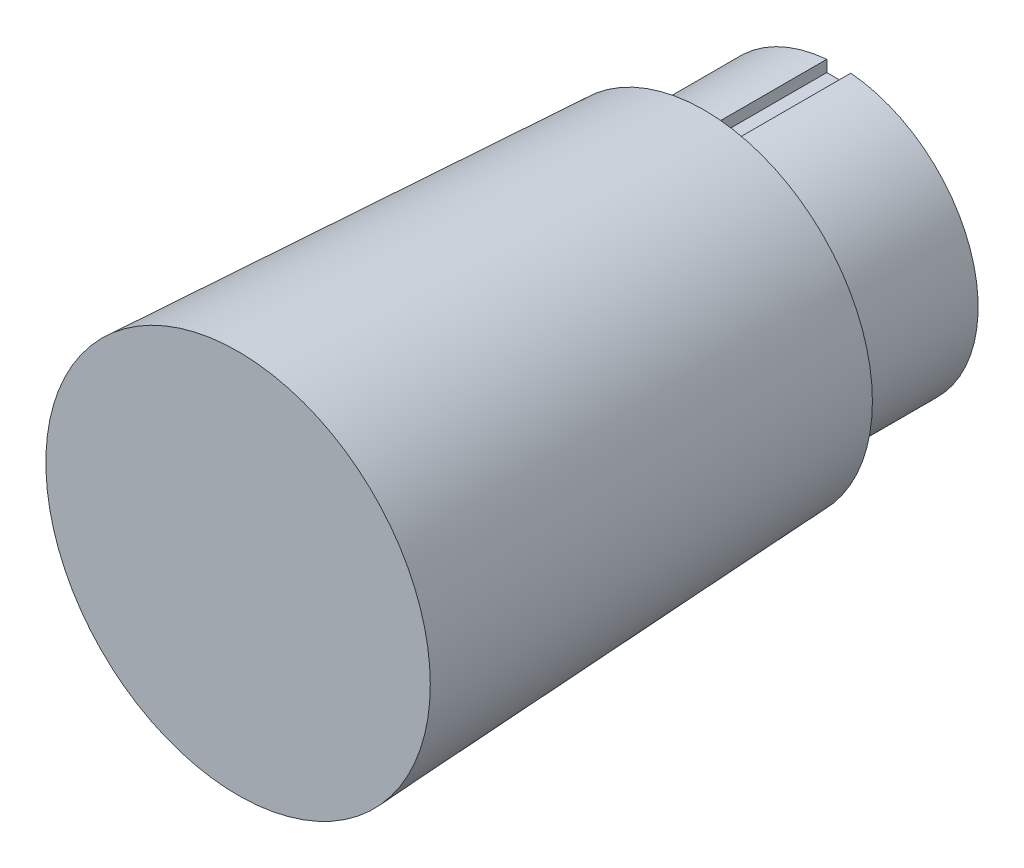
ISO-10303-21;
HEADER;
FILE_DESCRIPTION(('STEP AP214'),'2;1');
FILE_NAME('part.step','',(''),(''),'','','');
FILE_SCHEMA(('AUTOMOTIVE_DESIGN { 1 0 10303 214 1 1 1 1 }'));
ENDSEC;
DATA;
#1=APPLICATION_CONTEXT('core data for automotive mechanical design processes');
#2=APPLICATION_PROTOCOL_DEFINITION('international standard','automotive_design',2000,#1);
#3=PRODUCT_CONTEXT('',#1,'mechanical');
#4=PRODUCT('Part','Part','',(#3));
#5=PRODUCT_RELATED_PRODUCT_CATEGORY('part','',(#4));
#6=PRODUCT_DEFINITION_FORMATION('','',#4);
#7=PRODUCT_DEFINITION_CONTEXT('part definition',#1,'design');
#8=PRODUCT_DEFINITION('design','',#6,#7);
#9=PRODUCT_DEFINITION_SHAPE('','',#8);
#10=(LENGTH_UNIT() NAMED_UNIT(*) SI_UNIT(.MILLI.,.METRE.));
#11=(NAMED_UNIT(*) PLANE_ANGLE_UNIT() SI_UNIT($,.RADIAN.));
#12=(NAMED_UNIT(*) SI_UNIT($,.STERADIAN.) SOLID_ANGLE_UNIT());
#13=UNCERTAINTY_MEASURE_WITH_UNIT(LENGTH_MEASURE(1.E-05),#10,'distance_accuracy_value','');
#14=(GEOMETRIC_REPRESENTATION_CONTEXT(3) GLOBAL_UNCERTAINTY_ASSIGNED_CONTEXT((#13)) GLOBAL_UNIT_ASSIGNED_CONTEXT((#10,
#11,#12)) REPRESENTATION_CONTEXT('',''));
#15=CARTESIAN_POINT('',(0.,0.,0.));
#16=DIRECTION('',(0.,0.,1.));
#17=DIRECTION('',(1.,0.,0.));
#18=AXIS2_PLACEMENT_3D('',#15,#16,#17);
#19=CARTESIAN_POINT('',(0.,0.,0.));
#20=DIRECTION('',(0.,0.,-1.));
#21=DIRECTION('',(-1.,0.,0.));
#22=AXIS2_PLACEMENT_3D('',#19,#20,#21);
#23=PLANE('',#22);
#24=CARTESIAN_POINT('',(0.,0.,0.));
#25=DIRECTION('',(0.,0.,1.));
#26=DIRECTION('',(1.,0.,0.));
#27=AXIS2_PLACEMENT_3D('',#24,#25,#26);
#28=CIRCLE('',#27,40.);
#29=CARTESIAN_POINT('',(40.,0.,0.));
#30=VERTEX_POINT('',#29);
#31=EDGE_CURVE('E40',#30,#30,#28,.T.);
#32=ORIENTED_EDGE('',*,*,#31,.T.);
#33=EDGE_LOOP('',(#32));
#34=FACE_BOUND('',#33,.T.);
#35=ADVANCED_FACE('F33',(#34),#23,.F.);
#36=CARTESIAN_POINT('',(0.,0.,-97.));
#37=DIRECTION('',(0.,0.,1.));
#38=DIRECTION('',(1.,0.,0.));
#39=AXIS2_PLACEMENT_3D('',#36,#37,#38);
#40=CONICAL_SURFACE('',#39,35.,0.0515008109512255);
#41=ORIENTED_EDGE('',*,*,#31,.F.);
#42=EDGE_LOOP('',(#41));
#43=FACE_BOUND('',#42,.T.);
#44=CARTESIAN_POINT('',(0.,0.,-97.));
#45=DIRECTION('',(0.,0.,1.));
#46=DIRECTION('',(1.,0.,0.));
#47=AXIS2_PLACEMENT_3D('',#44,#45,#46);
#48=CIRCLE('',#47,35.);
#49=CARTESIAN_POINT('',(35.,0.,-97.));
#50=VERTEX_POINT('',#49);
#51=EDGE_CURVE('E107',#50,#50,#48,.T.);
#52=ORIENTED_EDGE('',*,*,#51,.T.);
#53=EDGE_LOOP('',(#52));
#54=FACE_BOUND('',#53,.T.);
#55=ADVANCED_FACE('F113',(#43,#54),#40,.T.);
#56=CARTESIAN_POINT('',(0.,29.,-97.));
#57=DIRECTION('',(0.,0.,1.));
#58=DIRECTION('',(1.,0.,0.));
#59=AXIS2_PLACEMENT_3D('',#56,#57,#58);
#60=PLANE('',#59);
#61=DIRECTION('',(0.,1.,0.));
#62=VECTOR('',#61,1.);
#63=CARTESIAN_POINT('',(-2.5,31.5,-97.));
#64=LINE('',#63,#62);
#65=CARTESIAN_POINT('',(-2.5,26.5,-97.));
#66=VERTEX_POINT('',#65);
#67=CARTESIAN_POINT('',(-2.5,28.8920404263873,-97.));
#68=VERTEX_POINT('',#67);
#69=EDGE_CURVE('E70',#66,#68,#64,.T.);
#70=ORIENTED_EDGE('',*,*,#69,.T.);
#71=CARTESIAN_POINT('',(0.,0.,-97.));
#72=DIRECTION('',(0.,0.,1.));
#73=DIRECTION('',(1.,0.,0.));
#74=AXIS2_PLACEMENT_3D('',#71,#72,#73);
#75=CIRCLE('',#74,29.);
#76=CARTESIAN_POINT('',(2.5,28.8920404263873,-97.));
#77=VERTEX_POINT('',#76);
#78=EDGE_CURVE('E105',#68,#77,#75,.T.);
#79=ORIENTED_EDGE('',*,*,#78,.T.);
#80=DIRECTION('',(0.,-1.,0.));
#81=VECTOR('',#80,1.);
#82=CARTESIAN_POINT('',(2.5,31.5,-97.));
#83=LINE('',#82,#81);
#84=CARTESIAN_POINT('',(2.5,26.5,-97.));
#85=VERTEX_POINT('',#84);
#86=EDGE_CURVE('E80',#77,#85,#83,.T.);
#87=ORIENTED_EDGE('',*,*,#86,.T.);
#88=DIRECTION('',(-1.,0.,0.));
#89=VECTOR('',#88,1.);
#90=CARTESIAN_POINT('',(-2.5,26.5,-97.));
#91=LINE('',#90,#89);
#92=EDGE_CURVE('E86',#85,#66,#91,.T.);
#93=ORIENTED_EDGE('',*,*,#92,.T.);
#94=EDGE_LOOP('',(#70,#79,#87,#93));
#95=FACE_BOUND('',#94,.T.);
#96=ORIENTED_EDGE('',*,*,#51,.F.);
#97=EDGE_LOOP('',(#96));
#98=FACE_BOUND('',#97,.T.);
#99=ADVANCED_FACE('F91',(#95,#98),#60,.F.);
#100=CARTESIAN_POINT('',(0.,0.,0.));
#101=DIRECTION('',(0.,0.,1.));
#102=DIRECTION('',(1.,0.,0.));
#103=AXIS2_PLACEMENT_3D('',#100,#101,#102);
#104=CYLINDRICAL_SURFACE('',#103,29.);
#105=ORIENTED_EDGE('',*,*,#78,.F.);
#106=DIRECTION('',(0.,0.,1.));
#107=VECTOR('',#106,1.);
#108=CARTESIAN_POINT('',(-2.5,28.8920404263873,0.));
#109=LINE('',#108,#107);
#110=CARTESIAN_POINT('',(-2.5,28.8920404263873,-125.));
#111=VERTEX_POINT('',#110);
#112=EDGE_CURVE('E75',#68,#111,#109,.F.);
#113=ORIENTED_EDGE('',*,*,#112,.T.);
#114=CARTESIAN_POINT('',(0.,0.,-125.));
#115=DIRECTION('',(0.,0.,1.));
#116=DIRECTION('',(1.,0.,0.));
#117=AXIS2_PLACEMENT_3D('',#114,#115,#116);
#118=CIRCLE('',#117,29.);
#119=CARTESIAN_POINT('',(2.5,28.8920404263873,-125.));
#120=VERTEX_POINT('',#119);
#121=EDGE_CURVE('E102',#111,#120,#118,.T.);
#122=ORIENTED_EDGE('',*,*,#121,.T.);
#123=DIRECTION('',(0.,0.,1.));
#124=VECTOR('',#123,1.);
#125=CARTESIAN_POINT('',(2.5,28.8920404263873,0.));
#126=LINE('',#125,#124);
#127=EDGE_CURVE('E47',#120,#77,#126,.T.);
#128=ORIENTED_EDGE('',*,*,#127,.T.);
#129=EDGE_LOOP('',(#105,#113,#122,#128));
#130=FACE_BOUND('',#129,.T.);
#131=ADVANCED_FACE('F118',(#130),#104,.T.);
#132=CARTESIAN_POINT('',(0.,29.,-125.));
#133=DIRECTION('',(0.,0.,1.));
#134=DIRECTION('',(1.,0.,0.));
#135=AXIS2_PLACEMENT_3D('',#132,#133,#134);
#136=PLANE('',#135);
#137=ORIENTED_EDGE('',*,*,#121,.F.);
#138=DIRECTION('',(0.,1.,0.));
#139=VECTOR('',#138,1.);
#140=CARTESIAN_POINT('',(-2.5,31.5,-125.));
#141=LINE('',#140,#139);
#142=CARTESIAN_POINT('',(-2.5,26.5,-125.));
#143=VERTEX_POINT('',#142);
#144=EDGE_CURVE('E54',#143,#111,#141,.T.);
#145=ORIENTED_EDGE('',*,*,#144,.F.);
#146=DIRECTION('',(-1.,0.,0.));
#147=VECTOR('',#146,1.);
#148=CARTESIAN_POINT('',(-2.5,26.5,-125.));
#149=LINE('',#148,#147);
#150=CARTESIAN_POINT('',(2.5,26.5,-125.));
#151=VERTEX_POINT('',#150);
#152=EDGE_CURVE('E89',#151,#143,#149,.T.);
#153=ORIENTED_EDGE('',*,*,#152,.F.);
#154=DIRECTION('',(0.,1.,0.));
#155=VECTOR('',#154,1.);
#156=CARTESIAN_POINT('',(2.5,29.,-125.));
#157=LINE('',#156,#155);
#158=EDGE_CURVE('E11',#151,#120,#157,.T.);
#159=ORIENTED_EDGE('',*,*,#158,.T.);
#160=EDGE_LOOP('',(#137,#145,#153,#159));
#161=FACE_BOUND('',#160,.T.);
#162=ADVANCED_FACE('F123',(#161),#136,.F.);
#163=CARTESIAN_POINT('',(-2.5,31.5,-89.9289321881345));
#164=DIRECTION('',(-1.,0.,0.));
#165=DIRECTION('',(0.,-1.,0.));
#166=AXIS2_PLACEMENT_3D('',#163,#164,#165);
#167=PLANE('',#166);
#168=ORIENTED_EDGE('',*,*,#69,.F.);
#169=DIRECTION('',(0.,0.,-1.));
#170=VECTOR('',#169,1.);
#171=CARTESIAN_POINT('',(-2.5,26.5,-89.9289321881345));
#172=LINE('',#171,#170);
#173=EDGE_CURVE('E73',#66,#143,#172,.T.);
#174=ORIENTED_EDGE('',*,*,#173,.T.);
#175=ORIENTED_EDGE('',*,*,#144,.T.);
#176=ORIENTED_EDGE('',*,*,#112,.F.);
#177=EDGE_LOOP('',(#168,#174,#175,#176));
#178=FACE_BOUND('',#177,.T.);
#179=ADVANCED_FACE('F72',(#178),#167,.F.);
#180=CARTESIAN_POINT('',(2.5,31.5,-89.9289321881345));
#181=DIRECTION('',(1.,0.,0.));
#182=DIRECTION('',(0.,1.,0.));
#183=AXIS2_PLACEMENT_3D('',#180,#181,#182);
#184=PLANE('',#183);
#185=ORIENTED_EDGE('',*,*,#158,.F.);
#186=DIRECTION('',(0.,0.,-1.));
#187=VECTOR('',#186,1.);
#188=CARTESIAN_POINT('',(2.5,26.5,-89.9289321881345));
#189=LINE('',#188,#187);
#190=EDGE_CURVE('E97',#85,#151,#189,.T.);
#191=ORIENTED_EDGE('',*,*,#190,.F.);
#192=ORIENTED_EDGE('',*,*,#86,.F.);
#193=ORIENTED_EDGE('',*,*,#127,.F.);
#194=EDGE_LOOP('',(#185,#191,#192,#193));
#195=FACE_BOUND('',#194,.T.);
#196=ADVANCED_FACE('F162',(#195),#184,.F.);
#197=CARTESIAN_POINT('',(-2.5,26.5,-89.9289321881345));
#198=DIRECTION('',(0.,-1.,0.));
#199=DIRECTION('',(0.,0.,-1.));
#200=AXIS2_PLACEMENT_3D('',#197,#198,#199);
#201=PLANE('',#200);
#202=ORIENTED_EDGE('',*,*,#190,.T.);
#203=ORIENTED_EDGE('',*,*,#152,.T.);
#204=ORIENTED_EDGE('',*,*,#173,.F.);
#205=ORIENTED_EDGE('',*,*,#92,.F.);
#206=EDGE_LOOP('',(#202,#203,#204,#205));
#207=FACE_BOUND('',#206,.T.);
#208=ADVANCED_FACE('F85',(#207),#201,.F.);
#209=CLOSED_SHELL('',(#35,#55,#99,#131,#162,#179,#196,#208));
#210=MANIFOLD_SOLID_BREP('B2',#209);
#211=ADVANCED_BREP_SHAPE_REPRESENTATION('',(#18,#210),#14);
#212=SHAPE_DEFINITION_REPRESENTATION(#9,#211);
ENDSEC;
END-ISO-10303-21;
